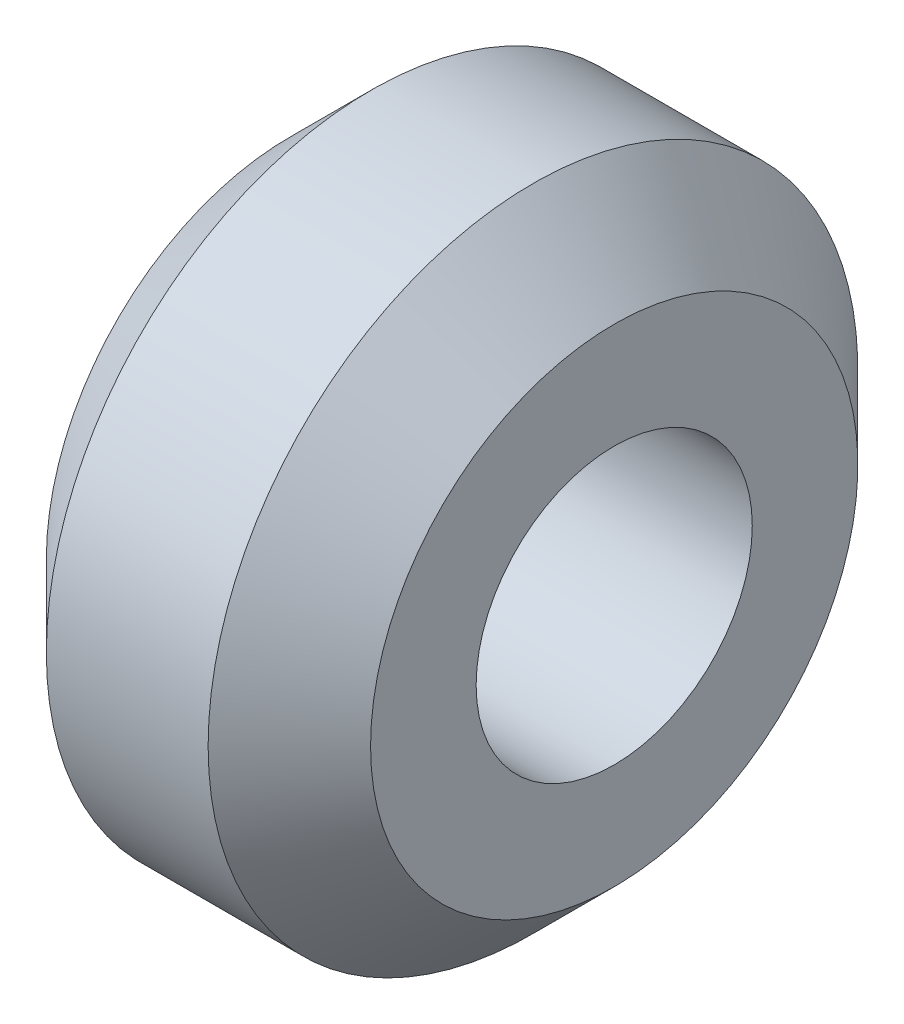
ISO-10303-21;
HEADER;
FILE_DESCRIPTION(('STEP AP214'),'2;1');
FILE_NAME('part.step','',(''),(''),'','','');
FILE_SCHEMA(('AUTOMOTIVE_DESIGN { 1 0 10303 214 1 1 1 1 }'));
ENDSEC;
DATA;
#1=APPLICATION_CONTEXT('core data for automotive mechanical design processes');
#2=APPLICATION_PROTOCOL_DEFINITION('international standard','automotive_design',2000,#1);
#3=PRODUCT_CONTEXT('',#1,'mechanical');
#4=PRODUCT('Part','Part','',(#3));
#5=PRODUCT_RELATED_PRODUCT_CATEGORY('part','',(#4));
#6=PRODUCT_DEFINITION_FORMATION('','',#4);
#7=PRODUCT_DEFINITION_CONTEXT('part definition',#1,'design');
#8=PRODUCT_DEFINITION('design','',#6,#7);
#9=PRODUCT_DEFINITION_SHAPE('','',#8);
#10=(LENGTH_UNIT() NAMED_UNIT(*) SI_UNIT(.MILLI.,.METRE.));
#11=(NAMED_UNIT(*) PLANE_ANGLE_UNIT() SI_UNIT($,.RADIAN.));
#12=(NAMED_UNIT(*) SI_UNIT($,.STERADIAN.) SOLID_ANGLE_UNIT());
#13=UNCERTAINTY_MEASURE_WITH_UNIT(LENGTH_MEASURE(1.E-05),#10,'distance_accuracy_value','');
#14=(GEOMETRIC_REPRESENTATION_CONTEXT(3) GLOBAL_UNCERTAINTY_ASSIGNED_CONTEXT((#13)) GLOBAL_UNIT_ASSIGNED_CONTEXT((#10,
#11,#12)) REPRESENTATION_CONTEXT('',''));
#15=CARTESIAN_POINT('',(0.,0.,0.));
#16=DIRECTION('',(0.,0.,1.));
#17=DIRECTION('',(1.,0.,0.));
#18=AXIS2_PLACEMENT_3D('',#15,#16,#17);
#19=CARTESIAN_POINT('',(8.51000000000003,7.5,0.));
#20=DIRECTION('',(1.,0.,0.));
#21=DIRECTION('',(0.,0.,-1.));
#22=AXIS2_PLACEMENT_3D('',#19,#20,#21);
#23=PLANE('',#22);
#24=CARTESIAN_POINT('',(8.51000000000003,0.,0.));
#25=DIRECTION('',(-1.,0.,0.));
#26=DIRECTION('',(0.,0.,1.));
#27=AXIS2_PLACEMENT_3D('',#24,#25,#26);
#28=CIRCLE('',#27,4.25);
#29=CARTESIAN_POINT('',(8.51000000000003,0.,4.25));
#30=VERTEX_POINT('',#29);
#31=EDGE_CURVE('E10',#30,#30,#28,.T.);
#32=ORIENTED_EDGE('',*,*,#31,.F.);
#33=EDGE_LOOP('',(#32));
#34=FACE_BOUND('',#33,.T.);
#35=CARTESIAN_POINT('',(8.51000000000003,0.,0.));
#36=DIRECTION('',(-1.,0.,0.));
#37=DIRECTION('',(0.,0.,1.));
#38=AXIS2_PLACEMENT_3D('',#35,#36,#37);
#39=CIRCLE('',#38,7.5);
#40=CARTESIAN_POINT('',(8.51000000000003,0.,7.5));
#41=VERTEX_POINT('',#40);
#42=EDGE_CURVE('E49',#41,#41,#39,.T.);
#43=ORIENTED_EDGE('',*,*,#42,.T.);
#44=EDGE_LOOP('',(#43));
#45=FACE_BOUND('',#44,.T.);
#46=ADVANCED_FACE('F27',(#34,#45),#23,.F.);
#47=CARTESIAN_POINT('',(-50.,0.,0.));
#48=DIRECTION('',(-1.,0.,0.));
#49=DIRECTION('',(0.,0.,1.));
#50=AXIS2_PLACEMENT_3D('',#47,#48,#49);
#51=CYLINDRICAL_SURFACE('',#50,4.25);
#52=CARTESIAN_POINT('',(18.49,0.,0.));
#53=DIRECTION('',(-1.,0.,0.));
#54=DIRECTION('',(0.,0.,1.));
#55=AXIS2_PLACEMENT_3D('',#52,#53,#54);
#56=CIRCLE('',#55,4.25);
#57=CARTESIAN_POINT('',(18.49,0.,4.25));
#58=VERTEX_POINT('',#57);
#59=EDGE_CURVE('E33',#58,#58,#56,.T.);
#60=ORIENTED_EDGE('',*,*,#59,.F.);
#61=EDGE_LOOP('',(#60));
#62=FACE_BOUND('',#61,.T.);
#63=ORIENTED_EDGE('',*,*,#31,.T.);
#64=EDGE_LOOP('',(#63));
#65=FACE_BOUND('',#64,.T.);
#66=ADVANCED_FACE('F74',(#62,#65),#51,.F.);
#67=CARTESIAN_POINT('',(18.49,7.5,0.));
#68=DIRECTION('',(-1.,0.,0.));
#69=DIRECTION('',(0.,0.,1.));
#70=AXIS2_PLACEMENT_3D('',#67,#68,#69);
#71=PLANE('',#70);
#72=CARTESIAN_POINT('',(18.49,0.,0.));
#73=DIRECTION('',(-1.,0.,0.));
#74=DIRECTION('',(0.,0.,1.));
#75=AXIS2_PLACEMENT_3D('',#72,#73,#74);
#76=CIRCLE('',#75,7.5);
#77=CARTESIAN_POINT('',(18.49,0.,7.5));
#78=VERTEX_POINT('',#77);
#79=EDGE_CURVE('E37',#78,#78,#76,.T.);
#80=ORIENTED_EDGE('',*,*,#79,.F.);
#81=EDGE_LOOP('',(#80));
#82=FACE_BOUND('',#81,.T.);
#83=ORIENTED_EDGE('',*,*,#59,.T.);
#84=EDGE_LOOP('',(#83));
#85=FACE_BOUND('',#84,.T.);
#86=ADVANCED_FACE('F69',(#82,#85),#71,.F.);
#87=CARTESIAN_POINT('',(18.49,0.,0.));
#88=DIRECTION('',(-1.,0.,0.));
#89=DIRECTION('',(0.,0.,1.));
#90=AXIS2_PLACEMENT_3D('',#87,#88,#89);
#91=CONICAL_SURFACE('',#90,7.5,0.78539816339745);
#92=CARTESIAN_POINT('',(15.99,0.,0.));
#93=DIRECTION('',(-1.,0.,0.));
#94=DIRECTION('',(0.,0.,1.));
#95=AXIS2_PLACEMENT_3D('',#92,#93,#94);
#96=CIRCLE('',#95,10.);
#97=CARTESIAN_POINT('',(15.99,0.,10.));
#98=VERTEX_POINT('',#97);
#99=EDGE_CURVE('E41',#98,#98,#96,.T.);
#100=ORIENTED_EDGE('',*,*,#99,.F.);
#101=EDGE_LOOP('',(#100));
#102=FACE_BOUND('',#101,.T.);
#103=ORIENTED_EDGE('',*,*,#79,.T.);
#104=EDGE_LOOP('',(#103));
#105=FACE_BOUND('',#104,.T.);
#106=ADVANCED_FACE('F63',(#102,#105),#91,.T.);
#107=CARTESIAN_POINT('',(-50.,0.,0.));
#108=DIRECTION('',(-1.,0.,0.));
#109=DIRECTION('',(0.,0.,1.));
#110=AXIS2_PLACEMENT_3D('',#107,#108,#109);
#111=CYLINDRICAL_SURFACE('',#110,10.);
#112=CARTESIAN_POINT('',(11.01,0.,0.));
#113=DIRECTION('',(-1.,0.,0.));
#114=DIRECTION('',(0.,0.,1.));
#115=AXIS2_PLACEMENT_3D('',#112,#113,#114);
#116=CIRCLE('',#115,10.);
#117=CARTESIAN_POINT('',(11.01,0.,10.));
#118=VERTEX_POINT('',#117);
#119=EDGE_CURVE('E46',#118,#118,#116,.T.);
#120=ORIENTED_EDGE('',*,*,#119,.F.);
#121=EDGE_LOOP('',(#120));
#122=FACE_BOUND('',#121,.T.);
#123=ORIENTED_EDGE('',*,*,#99,.T.);
#124=EDGE_LOOP('',(#123));
#125=FACE_BOUND('',#124,.T.);
#126=ADVANCED_FACE('F57',(#122,#125),#111,.T.);
#127=CARTESIAN_POINT('',(11.01,0.,0.));
#128=DIRECTION('',(1.,0.,0.));
#129=DIRECTION('',(0.,0.,-1.));
#130=AXIS2_PLACEMENT_3D('',#127,#128,#129);
#131=CONICAL_SURFACE('',#130,10.,0.785398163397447);
#132=ORIENTED_EDGE('',*,*,#42,.F.);
#133=EDGE_LOOP('',(#132));
#134=FACE_BOUND('',#133,.T.);
#135=ORIENTED_EDGE('',*,*,#119,.T.);
#136=EDGE_LOOP('',(#135));
#137=FACE_BOUND('',#136,.T.);
#138=ADVANCED_FACE('F54',(#134,#137),#131,.T.);
#139=CLOSED_SHELL('',(#46,#66,#86,#106,#126,#138));
#140=MANIFOLD_SOLID_BREP('B2',#139);
#141=ADVANCED_BREP_SHAPE_REPRESENTATION('',(#18,#140),#14);
#142=SHAPE_DEFINITION_REPRESENTATION(#9,#141);
ENDSEC;
END-ISO-10303-21;
